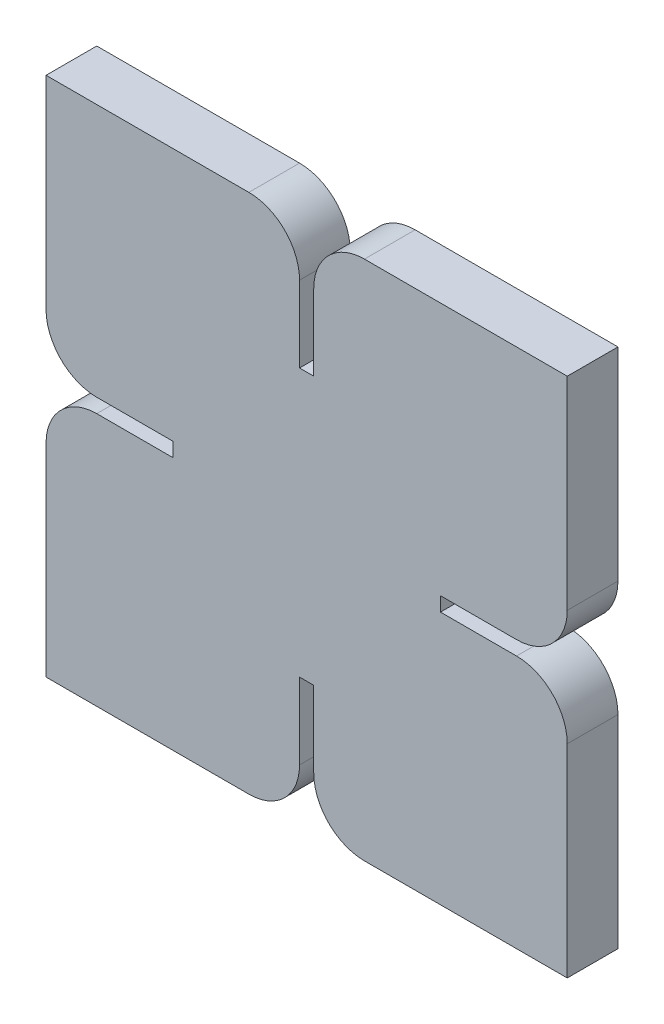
ISO-10303-21;
HEADER;
FILE_DESCRIPTION(('STEP AP214'),'2;1');
FILE_NAME('part.step','',(''),(''),'','','');
FILE_SCHEMA(('AUTOMOTIVE_DESIGN { 1 0 10303 214 1 1 1 1 }'));
ENDSEC;
DATA;
#1=APPLICATION_CONTEXT('core data for automotive mechanical design processes');
#2=APPLICATION_PROTOCOL_DEFINITION('international standard','automotive_design',2000,#1);
#3=PRODUCT_CONTEXT('',#1,'mechanical');
#4=PRODUCT('Part','Part','',(#3));
#5=PRODUCT_RELATED_PRODUCT_CATEGORY('part','',(#4));
#6=PRODUCT_DEFINITION_FORMATION('','',#4);
#7=PRODUCT_DEFINITION_CONTEXT('part definition',#1,'design');
#8=PRODUCT_DEFINITION('design','',#6,#7);
#9=PRODUCT_DEFINITION_SHAPE('','',#8);
#10=(LENGTH_UNIT() NAMED_UNIT(*) SI_UNIT(.MILLI.,.METRE.));
#11=(NAMED_UNIT(*) PLANE_ANGLE_UNIT() SI_UNIT($,.RADIAN.));
#12=(NAMED_UNIT(*) SI_UNIT($,.STERADIAN.) SOLID_ANGLE_UNIT());
#13=UNCERTAINTY_MEASURE_WITH_UNIT(LENGTH_MEASURE(1.E-05),#10,'distance_accuracy_value','');
#14=(GEOMETRIC_REPRESENTATION_CONTEXT(3) GLOBAL_UNCERTAINTY_ASSIGNED_CONTEXT((#13)) GLOBAL_UNIT_ASSIGNED_CONTEXT((#10,
#11,#12)) REPRESENTATION_CONTEXT('',''));
#15=CARTESIAN_POINT('',(0.,0.,0.));
#16=DIRECTION('',(0.,0.,1.));
#17=DIRECTION('',(1.,0.,0.));
#18=AXIS2_PLACEMENT_3D('',#15,#16,#17);
#19=CARTESIAN_POINT('',(-11.4,-41.4,10.));
#20=DIRECTION('',(0.,0.,-1.));
#21=DIRECTION('',(-1.,0.,0.));
#22=AXIS2_PLACEMENT_3D('',#19,#20,#21);
#23=CYLINDRICAL_SURFACE('',#22,10.);
#24=CARTESIAN_POINT('',(-11.4,-41.4,0.));
#25=DIRECTION('',(0.,0.,1.));
#26=DIRECTION('',(1.,0.,0.));
#27=AXIS2_PLACEMENT_3D('',#24,#25,#26);
#28=CIRCLE('',#27,10.);
#29=CARTESIAN_POINT('',(-1.39999999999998,-41.4,0.));
#30=VERTEX_POINT('',#29);
#31=CARTESIAN_POINT('',(-11.4,-51.4,0.));
#32=VERTEX_POINT('',#31);
#33=EDGE_CURVE('E246',#30,#32,#28,.F.);
#34=ORIENTED_EDGE('',*,*,#33,.F.);
#35=DIRECTION('',(0.,0.,-1.));
#36=VECTOR('',#35,1.);
#37=CARTESIAN_POINT('',(-1.39999999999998,-41.4,10.));
#38=LINE('',#37,#36);
#39=CARTESIAN_POINT('',(-1.39999999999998,-41.4,10.));
#40=VERTEX_POINT('',#39);
#41=EDGE_CURVE('E11',#40,#30,#38,.T.);
#42=ORIENTED_EDGE('',*,*,#41,.F.);
#43=CARTESIAN_POINT('',(-11.4,-41.4,10.));
#44=DIRECTION('',(0.,0.,1.));
#45=DIRECTION('',(1.,0.,0.));
#46=AXIS2_PLACEMENT_3D('',#43,#44,#45);
#47=CIRCLE('',#46,10.);
#48=CARTESIAN_POINT('',(-11.4,-51.4,10.));
#49=VERTEX_POINT('',#48);
#50=EDGE_CURVE('E319',#40,#49,#47,.F.);
#51=ORIENTED_EDGE('',*,*,#50,.T.);
#52=DIRECTION('',(0.,0.,-1.));
#53=VECTOR('',#52,1.);
#54=CARTESIAN_POINT('',(-11.4,-51.4,10.));
#55=LINE('',#54,#53);
#56=EDGE_CURVE('E146',#49,#32,#55,.T.);
#57=ORIENTED_EDGE('',*,*,#56,.T.);
#58=EDGE_LOOP('',(#34,#42,#51,#57));
#59=FACE_BOUND('',#58,.T.);
#60=ADVANCED_FACE('F35',(#59),#23,.T.);
#61=CARTESIAN_POINT('',(-1.40000000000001,0.,10.));
#62=DIRECTION('',(1.,0.,0.));
#63=DIRECTION('',(0.,1.,0.));
#64=AXIS2_PLACEMENT_3D('',#61,#62,#63);
#65=PLANE('',#64);
#66=DIRECTION('',(0.,-1.,0.));
#67=VECTOR('',#66,1.);
#68=CARTESIAN_POINT('',(-1.40000000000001,0.,0.));
#69=LINE('',#68,#67);
#70=CARTESIAN_POINT('',(-1.39999999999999,-26.4,0.));
#71=VERTEX_POINT('',#70);
#72=EDGE_CURVE('E249',#71,#30,#69,.T.);
#73=ORIENTED_EDGE('',*,*,#72,.F.);
#74=DIRECTION('',(0.,0.,-1.));
#75=VECTOR('',#74,1.);
#76=CARTESIAN_POINT('',(-1.39999999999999,-26.4,10.));
#77=LINE('',#76,#75);
#78=CARTESIAN_POINT('',(-1.39999999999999,-26.4,10.));
#79=VERTEX_POINT('',#78);
#80=EDGE_CURVE('E43',#79,#71,#77,.T.);
#81=ORIENTED_EDGE('',*,*,#80,.F.);
#82=DIRECTION('',(0.,-1.,0.));
#83=VECTOR('',#82,1.);
#84=CARTESIAN_POINT('',(-1.40000000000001,0.,10.));
#85=LINE('',#84,#83);
#86=EDGE_CURVE('E387',#79,#40,#85,.T.);
#87=ORIENTED_EDGE('',*,*,#86,.T.);
#88=ORIENTED_EDGE('',*,*,#41,.T.);
#89=EDGE_LOOP('',(#73,#81,#87,#88));
#90=FACE_BOUND('',#89,.T.);
#91=ADVANCED_FACE('F386',(#90),#65,.T.);
#92=CARTESIAN_POINT('',(0.,-26.4,10.));
#93=DIRECTION('',(0.,1.,0.));
#94=DIRECTION('',(0.,0.,1.));
#95=AXIS2_PLACEMENT_3D('',#92,#93,#94);
#96=PLANE('',#95);
#97=DIRECTION('',(1.,0.,0.));
#98=VECTOR('',#97,1.);
#99=CARTESIAN_POINT('',(0.,-26.4,0.));
#100=LINE('',#99,#98);
#101=CARTESIAN_POINT('',(1.40000000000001,-26.4,0.));
#102=VERTEX_POINT('',#101);
#103=EDGE_CURVE('E252',#71,#102,#100,.T.);
#104=ORIENTED_EDGE('',*,*,#103,.T.);
#105=DIRECTION('',(0.,0.,-1.));
#106=VECTOR('',#105,1.);
#107=CARTESIAN_POINT('',(1.40000000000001,-26.4,10.));
#108=LINE('',#107,#106);
#109=CARTESIAN_POINT('',(1.40000000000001,-26.4,10.));
#110=VERTEX_POINT('',#109);
#111=EDGE_CURVE('E370',#110,#102,#108,.T.);
#112=ORIENTED_EDGE('',*,*,#111,.F.);
#113=DIRECTION('',(1.,0.,0.));
#114=VECTOR('',#113,1.);
#115=CARTESIAN_POINT('',(0.,-26.4,10.));
#116=LINE('',#115,#114);
#117=EDGE_CURVE('E377',#79,#110,#116,.T.);
#118=ORIENTED_EDGE('',*,*,#117,.F.);
#119=ORIENTED_EDGE('',*,*,#80,.T.);
#120=EDGE_LOOP('',(#104,#112,#118,#119));
#121=FACE_BOUND('',#120,.T.);
#122=ADVANCED_FACE('F375',(#121),#96,.F.);
#123=CARTESIAN_POINT('',(1.40000000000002,0.,10.));
#124=DIRECTION('',(1.,0.,0.));
#125=DIRECTION('',(0.,1.,0.));
#126=AXIS2_PLACEMENT_3D('',#123,#124,#125);
#127=PLANE('',#126);
#128=DIRECTION('',(0.,-1.,0.));
#129=VECTOR('',#128,1.);
#130=CARTESIAN_POINT('',(1.40000000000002,0.,0.));
#131=LINE('',#130,#129);
#132=CARTESIAN_POINT('',(1.4,-41.4,0.));
#133=VERTEX_POINT('',#132);
#134=EDGE_CURVE('E254',#102,#133,#131,.T.);
#135=ORIENTED_EDGE('',*,*,#134,.T.);
#136=DIRECTION('',(0.,0.,-1.));
#137=VECTOR('',#136,1.);
#138=CARTESIAN_POINT('',(1.4,-41.4,10.));
#139=LINE('',#138,#137);
#140=CARTESIAN_POINT('',(1.4,-41.4,10.));
#141=VERTEX_POINT('',#140);
#142=EDGE_CURVE('E367',#141,#133,#139,.T.);
#143=ORIENTED_EDGE('',*,*,#142,.F.);
#144=DIRECTION('',(0.,-1.,0.));
#145=VECTOR('',#144,1.);
#146=CARTESIAN_POINT('',(1.40000000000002,0.,10.));
#147=LINE('',#146,#145);
#148=EDGE_CURVE('E395',#110,#141,#147,.T.);
#149=ORIENTED_EDGE('',*,*,#148,.F.);
#150=ORIENTED_EDGE('',*,*,#111,.T.);
#151=EDGE_LOOP('',(#135,#143,#149,#150));
#152=FACE_BOUND('',#151,.T.);
#153=ADVANCED_FACE('F538',(#152),#127,.F.);
#154=CARTESIAN_POINT('',(11.4,-41.4,10.));
#155=DIRECTION('',(0.,0.,-1.));
#156=DIRECTION('',(-1.,0.,0.));
#157=AXIS2_PLACEMENT_3D('',#154,#155,#156);
#158=CYLINDRICAL_SURFACE('',#157,10.);
#159=CARTESIAN_POINT('',(11.4,-41.4,0.));
#160=DIRECTION('',(0.,0.,1.));
#161=DIRECTION('',(1.,0.,0.));
#162=AXIS2_PLACEMENT_3D('',#159,#160,#161);
#163=CIRCLE('',#162,10.);
#164=CARTESIAN_POINT('',(11.4,-51.4,0.));
#165=VERTEX_POINT('',#164);
#166=EDGE_CURVE('E256',#133,#165,#163,.T.);
#167=ORIENTED_EDGE('',*,*,#166,.T.);
#168=DIRECTION('',(0.,0.,-1.));
#169=VECTOR('',#168,1.);
#170=CARTESIAN_POINT('',(11.4,-51.4,10.));
#171=LINE('',#170,#169);
#172=CARTESIAN_POINT('',(11.4,-51.4,10.));
#173=VERTEX_POINT('',#172);
#174=EDGE_CURVE('E365',#173,#165,#171,.T.);
#175=ORIENTED_EDGE('',*,*,#174,.F.);
#176=CARTESIAN_POINT('',(11.4,-41.4,10.));
#177=DIRECTION('',(0.,0.,1.));
#178=DIRECTION('',(1.,0.,0.));
#179=AXIS2_PLACEMENT_3D('',#176,#177,#178);
#180=CIRCLE('',#179,10.);
#181=EDGE_CURVE('E397',#141,#173,#180,.T.);
#182=ORIENTED_EDGE('',*,*,#181,.F.);
#183=ORIENTED_EDGE('',*,*,#142,.T.);
#184=EDGE_LOOP('',(#167,#175,#182,#183));
#185=FACE_BOUND('',#184,.T.);
#186=ADVANCED_FACE('F534',(#185),#158,.T.);
#187=CARTESIAN_POINT('',(0.,-51.4,10.));
#188=DIRECTION('',(0.,-1.,0.));
#189=DIRECTION('',(1.,0.,0.));
#190=AXIS2_PLACEMENT_3D('',#187,#188,#189);
#191=PLANE('',#190);
#192=DIRECTION('',(-1.,0.,0.));
#193=VECTOR('',#192,1.);
#194=CARTESIAN_POINT('',(0.,-51.4,0.));
#195=LINE('',#194,#193);
#196=CARTESIAN_POINT('',(51.4,-51.4,0.));
#197=VERTEX_POINT('',#196);
#198=EDGE_CURVE('E259',#197,#165,#195,.T.);
#199=ORIENTED_EDGE('',*,*,#198,.F.);
#200=DIRECTION('',(0.,0.,-1.));
#201=VECTOR('',#200,1.);
#202=CARTESIAN_POINT('',(51.4,-51.4,10.));
#203=LINE('',#202,#201);
#204=CARTESIAN_POINT('',(51.4,-51.4,10.));
#205=VERTEX_POINT('',#204);
#206=EDGE_CURVE('E363',#205,#197,#203,.T.);
#207=ORIENTED_EDGE('',*,*,#206,.F.);
#208=DIRECTION('',(-1.,0.,0.));
#209=VECTOR('',#208,1.);
#210=CARTESIAN_POINT('',(0.,-51.4,10.));
#211=LINE('',#210,#209);
#212=EDGE_CURVE('E399',#205,#173,#211,.T.);
#213=ORIENTED_EDGE('',*,*,#212,.T.);
#214=ORIENTED_EDGE('',*,*,#174,.T.);
#215=EDGE_LOOP('',(#199,#207,#213,#214));
#216=FACE_BOUND('',#215,.T.);
#217=ADVANCED_FACE('F529',(#216),#191,.T.);
#218=CARTESIAN_POINT('',(51.4,0.,10.));
#219=DIRECTION('',(1.,0.,0.));
#220=DIRECTION('',(0.,1.,0.));
#221=AXIS2_PLACEMENT_3D('',#218,#219,#220);
#222=PLANE('',#221);
#223=DIRECTION('',(0.,-1.,0.));
#224=VECTOR('',#223,1.);
#225=CARTESIAN_POINT('',(51.4,0.,0.));
#226=LINE('',#225,#224);
#227=CARTESIAN_POINT('',(51.4,-11.4,0.));
#228=VERTEX_POINT('',#227);
#229=EDGE_CURVE('E262',#228,#197,#226,.T.);
#230=ORIENTED_EDGE('',*,*,#229,.F.);
#231=DIRECTION('',(0.,0.,-1.));
#232=VECTOR('',#231,1.);
#233=CARTESIAN_POINT('',(51.4,-11.4,10.));
#234=LINE('',#233,#232);
#235=CARTESIAN_POINT('',(51.4,-11.4,10.));
#236=VERTEX_POINT('',#235);
#237=EDGE_CURVE('E361',#236,#228,#234,.T.);
#238=ORIENTED_EDGE('',*,*,#237,.F.);
#239=DIRECTION('',(0.,-1.,0.));
#240=VECTOR('',#239,1.);
#241=CARTESIAN_POINT('',(51.4,0.,10.));
#242=LINE('',#241,#240);
#243=EDGE_CURVE('E402',#236,#205,#242,.T.);
#244=ORIENTED_EDGE('',*,*,#243,.T.);
#245=ORIENTED_EDGE('',*,*,#206,.T.);
#246=EDGE_LOOP('',(#230,#238,#244,#245));
#247=FACE_BOUND('',#246,.T.);
#248=ADVANCED_FACE('F526',(#247),#222,.T.);
#249=CARTESIAN_POINT('',(41.4,-11.4,10.));
#250=DIRECTION('',(0.,0.,-1.));
#251=DIRECTION('',(-1.,0.,0.));
#252=AXIS2_PLACEMENT_3D('',#249,#250,#251);
#253=CYLINDRICAL_SURFACE('',#252,10.);
#254=CARTESIAN_POINT('',(41.4,-11.4,0.));
#255=DIRECTION('',(0.,0.,1.));
#256=DIRECTION('',(1.,0.,0.));
#257=AXIS2_PLACEMENT_3D('',#254,#255,#256);
#258=CIRCLE('',#257,10.);
#259=CARTESIAN_POINT('',(41.4,-1.40000000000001,0.));
#260=VERTEX_POINT('',#259);
#261=EDGE_CURVE('E265',#260,#228,#258,.F.);
#262=ORIENTED_EDGE('',*,*,#261,.F.);
#263=DIRECTION('',(0.,0.,-1.));
#264=VECTOR('',#263,1.);
#265=CARTESIAN_POINT('',(41.4,-1.40000000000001,10.));
#266=LINE('',#265,#264);
#267=CARTESIAN_POINT('',(41.4,-1.40000000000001,10.));
#268=VERTEX_POINT('',#267);
#269=EDGE_CURVE('E359',#268,#260,#266,.T.);
#270=ORIENTED_EDGE('',*,*,#269,.F.);
#271=CARTESIAN_POINT('',(41.4,-11.4,10.));
#272=DIRECTION('',(0.,0.,1.));
#273=DIRECTION('',(1.,0.,0.));
#274=AXIS2_PLACEMENT_3D('',#271,#272,#273);
#275=CIRCLE('',#274,10.);
#276=EDGE_CURVE('E405',#268,#236,#275,.F.);
#277=ORIENTED_EDGE('',*,*,#276,.T.);
#278=ORIENTED_EDGE('',*,*,#237,.T.);
#279=EDGE_LOOP('',(#262,#270,#277,#278));
#280=FACE_BOUND('',#279,.T.);
#281=ADVANCED_FACE('F520',(#280),#253,.T.);
#282=CARTESIAN_POINT('',(0.,-1.4,10.));
#283=DIRECTION('',(0.,-1.,0.));
#284=DIRECTION('',(1.,0.,0.));
#285=AXIS2_PLACEMENT_3D('',#282,#283,#284);
#286=PLANE('',#285);
#287=DIRECTION('',(-1.,0.,0.));
#288=VECTOR('',#287,1.);
#289=CARTESIAN_POINT('',(0.,-1.4,0.));
#290=LINE('',#289,#288);
#291=CARTESIAN_POINT('',(26.4,-1.40000000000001,0.));
#292=VERTEX_POINT('',#291);
#293=EDGE_CURVE('E268',#260,#292,#290,.T.);
#294=ORIENTED_EDGE('',*,*,#293,.T.);
#295=DIRECTION('',(0.,0.,-1.));
#296=VECTOR('',#295,1.);
#297=CARTESIAN_POINT('',(26.4,-1.40000000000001,10.));
#298=LINE('',#297,#296);
#299=CARTESIAN_POINT('',(26.4,-1.40000000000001,10.));
#300=VERTEX_POINT('',#299);
#301=EDGE_CURVE('E357',#300,#292,#298,.T.);
#302=ORIENTED_EDGE('',*,*,#301,.F.);
#303=DIRECTION('',(-1.,0.,0.));
#304=VECTOR('',#303,1.);
#305=CARTESIAN_POINT('',(0.,-1.4,10.));
#306=LINE('',#305,#304);
#307=EDGE_CURVE('E408',#268,#300,#306,.T.);
#308=ORIENTED_EDGE('',*,*,#307,.F.);
#309=ORIENTED_EDGE('',*,*,#269,.T.);
#310=EDGE_LOOP('',(#294,#302,#308,#309));
#311=FACE_BOUND('',#310,.T.);
#312=ADVANCED_FACE('F539',(#311),#286,.F.);
#313=CARTESIAN_POINT('',(26.4,0.,10.));
#314=DIRECTION('',(1.,0.,0.));
#315=DIRECTION('',(0.,0.,-1.));
#316=AXIS2_PLACEMENT_3D('',#313,#314,#315);
#317=PLANE('',#316);
#318=DIRECTION('',(0.,-1.,0.));
#319=VECTOR('',#318,1.);
#320=CARTESIAN_POINT('',(26.4,0.,0.));
#321=LINE('',#320,#319);
#322=CARTESIAN_POINT('',(26.4,1.40000000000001,0.));
#323=VERTEX_POINT('',#322);
#324=EDGE_CURVE('E271',#323,#292,#321,.T.);
#325=ORIENTED_EDGE('',*,*,#324,.F.);
#326=DIRECTION('',(0.,0.,-1.));
#327=VECTOR('',#326,1.);
#328=CARTESIAN_POINT('',(26.4,1.40000000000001,10.));
#329=LINE('',#328,#327);
#330=CARTESIAN_POINT('',(26.4,1.40000000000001,10.));
#331=VERTEX_POINT('',#330);
#332=EDGE_CURVE('E355',#331,#323,#329,.T.);
#333=ORIENTED_EDGE('',*,*,#332,.F.);
#334=DIRECTION('',(0.,-1.,0.));
#335=VECTOR('',#334,1.);
#336=CARTESIAN_POINT('',(26.4,0.,10.));
#337=LINE('',#336,#335);
#338=EDGE_CURVE('E410',#331,#300,#337,.T.);
#339=ORIENTED_EDGE('',*,*,#338,.T.);
#340=ORIENTED_EDGE('',*,*,#301,.T.);
#341=EDGE_LOOP('',(#325,#333,#339,#340));
#342=FACE_BOUND('',#341,.T.);
#343=ADVANCED_FACE('F514',(#342),#317,.T.);
#344=CARTESIAN_POINT('',(0.,1.4,10.));
#345=DIRECTION('',(0.,-1.,0.));
#346=DIRECTION('',(1.,0.,0.));
#347=AXIS2_PLACEMENT_3D('',#344,#345,#346);
#348=PLANE('',#347);
#349=DIRECTION('',(-1.,0.,0.));
#350=VECTOR('',#349,1.);
#351=CARTESIAN_POINT('',(0.,1.4,0.));
#352=LINE('',#351,#350);
#353=CARTESIAN_POINT('',(41.4,1.40000000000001,0.));
#354=VERTEX_POINT('',#353);
#355=EDGE_CURVE('E274',#354,#323,#352,.T.);
#356=ORIENTED_EDGE('',*,*,#355,.F.);
#357=DIRECTION('',(0.,0.,-1.));
#358=VECTOR('',#357,1.);
#359=CARTESIAN_POINT('',(41.4,1.40000000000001,10.));
#360=LINE('',#359,#358);
#361=CARTESIAN_POINT('',(41.4,1.40000000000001,10.));
#362=VERTEX_POINT('',#361);
#363=EDGE_CURVE('E353',#362,#354,#360,.T.);
#364=ORIENTED_EDGE('',*,*,#363,.F.);
#365=DIRECTION('',(-1.,0.,0.));
#366=VECTOR('',#365,1.);
#367=CARTESIAN_POINT('',(0.,1.4,10.));
#368=LINE('',#367,#366);
#369=EDGE_CURVE('E413',#362,#331,#368,.T.);
#370=ORIENTED_EDGE('',*,*,#369,.T.);
#371=ORIENTED_EDGE('',*,*,#332,.T.);
#372=EDGE_LOOP('',(#356,#364,#370,#371));
#373=FACE_BOUND('',#372,.T.);
#374=ADVANCED_FACE('F508',(#373),#348,.T.);
#375=CARTESIAN_POINT('',(41.4,11.4,10.));
#376=DIRECTION('',(0.,0.,-1.));
#377=DIRECTION('',(-1.,0.,0.));
#378=AXIS2_PLACEMENT_3D('',#375,#376,#377);
#379=CYLINDRICAL_SURFACE('',#378,10.);
#380=CARTESIAN_POINT('',(41.4,11.4,0.));
#381=DIRECTION('',(0.,0.,1.));
#382=DIRECTION('',(1.,0.,0.));
#383=AXIS2_PLACEMENT_3D('',#380,#381,#382);
#384=CIRCLE('',#383,10.);
#385=CARTESIAN_POINT('',(51.4,11.4,0.));
#386=VERTEX_POINT('',#385);
#387=EDGE_CURVE('E277',#354,#386,#384,.T.);
#388=ORIENTED_EDGE('',*,*,#387,.T.);
#389=DIRECTION('',(0.,0.,-1.));
#390=VECTOR('',#389,1.);
#391=CARTESIAN_POINT('',(51.4,11.4,10.));
#392=LINE('',#391,#390);
#393=CARTESIAN_POINT('',(51.4,11.4,10.));
#394=VERTEX_POINT('',#393);
#395=EDGE_CURVE('E350',#394,#386,#392,.T.);
#396=ORIENTED_EDGE('',*,*,#395,.F.);
#397=CARTESIAN_POINT('',(41.4,11.4,10.));
#398=DIRECTION('',(0.,0.,1.));
#399=DIRECTION('',(1.,0.,0.));
#400=AXIS2_PLACEMENT_3D('',#397,#398,#399);
#401=CIRCLE('',#400,10.);
#402=EDGE_CURVE('E416',#362,#394,#401,.T.);
#403=ORIENTED_EDGE('',*,*,#402,.F.);
#404=ORIENTED_EDGE('',*,*,#363,.T.);
#405=EDGE_LOOP('',(#388,#396,#403,#404));
#406=FACE_BOUND('',#405,.T.);
#407=ADVANCED_FACE('F591',(#406),#379,.T.);
#408=CARTESIAN_POINT('',(51.4,0.,10.));
#409=DIRECTION('',(-1.,0.,0.));
#410=DIRECTION('',(0.,-1.,0.));
#411=AXIS2_PLACEMENT_3D('',#408,#409,#410);
#412=PLANE('',#411);
#413=DIRECTION('',(0.,1.,0.));
#414=VECTOR('',#413,1.);
#415=CARTESIAN_POINT('',(51.4,0.,0.));
#416=LINE('',#415,#414);
#417=CARTESIAN_POINT('',(51.4,51.4,0.));
#418=VERTEX_POINT('',#417);
#419=EDGE_CURVE('E279',#386,#418,#416,.T.);
#420=ORIENTED_EDGE('',*,*,#419,.T.);
#421=DIRECTION('',(0.,0.,-1.));
#422=VECTOR('',#421,1.);
#423=CARTESIAN_POINT('',(51.4,51.4,10.));
#424=LINE('',#423,#422);
#425=CARTESIAN_POINT('',(51.4,51.4,10.));
#426=VERTEX_POINT('',#425);
#427=EDGE_CURVE('E347',#426,#418,#424,.T.);
#428=ORIENTED_EDGE('',*,*,#427,.F.);
#429=DIRECTION('',(0.,1.,0.));
#430=VECTOR('',#429,1.);
#431=CARTESIAN_POINT('',(51.4,0.,10.));
#432=LINE('',#431,#430);
#433=EDGE_CURVE('E418',#394,#426,#432,.T.);
#434=ORIENTED_EDGE('',*,*,#433,.F.);
#435=ORIENTED_EDGE('',*,*,#395,.T.);
#436=EDGE_LOOP('',(#420,#428,#434,#435));
#437=FACE_BOUND('',#436,.T.);
#438=ADVANCED_FACE('F502',(#437),#412,.F.);
#439=CARTESIAN_POINT('',(0.,51.4,10.));
#440=DIRECTION('',(0.,-1.,0.));
#441=DIRECTION('',(1.,0.,0.));
#442=AXIS2_PLACEMENT_3D('',#439,#440,#441);
#443=PLANE('',#442);
#444=DIRECTION('',(-1.,0.,0.));
#445=VECTOR('',#444,1.);
#446=CARTESIAN_POINT('',(0.,51.4,0.));
#447=LINE('',#446,#445);
#448=CARTESIAN_POINT('',(11.4,51.4,0.));
#449=VERTEX_POINT('',#448);
#450=EDGE_CURVE('E281',#418,#449,#447,.T.);
#451=ORIENTED_EDGE('',*,*,#450,.T.);
#452=DIRECTION('',(0.,0.,-1.));
#453=VECTOR('',#452,1.);
#454=CARTESIAN_POINT('',(11.4,51.4,10.));
#455=LINE('',#454,#453);
#456=CARTESIAN_POINT('',(11.4,51.4,10.));
#457=VERTEX_POINT('',#456);
#458=EDGE_CURVE('E345',#457,#449,#455,.T.);
#459=ORIENTED_EDGE('',*,*,#458,.F.);
#460=DIRECTION('',(-1.,0.,0.));
#461=VECTOR('',#460,1.);
#462=CARTESIAN_POINT('',(0.,51.4,10.));
#463=LINE('',#462,#461);
#464=EDGE_CURVE('E420',#426,#457,#463,.T.);
#465=ORIENTED_EDGE('',*,*,#464,.F.);
#466=ORIENTED_EDGE('',*,*,#427,.T.);
#467=EDGE_LOOP('',(#451,#459,#465,#466));
#468=FACE_BOUND('',#467,.T.);
#469=ADVANCED_FACE('F498',(#468),#443,.F.);
#470=CARTESIAN_POINT('',(11.4,41.4,10.));
#471=DIRECTION('',(0.,0.,-1.));
#472=DIRECTION('',(-1.,0.,0.));
#473=AXIS2_PLACEMENT_3D('',#470,#471,#472);
#474=CYLINDRICAL_SURFACE('',#473,10.);
#475=CARTESIAN_POINT('',(11.4,41.4,0.));
#476=DIRECTION('',(0.,0.,1.));
#477=DIRECTION('',(1.,0.,0.));
#478=AXIS2_PLACEMENT_3D('',#475,#476,#477);
#479=CIRCLE('',#478,10.);
#480=CARTESIAN_POINT('',(1.4,41.4,0.));
#481=VERTEX_POINT('',#480);
#482=EDGE_CURVE('E284',#481,#449,#479,.F.);
#483=ORIENTED_EDGE('',*,*,#482,.F.);
#484=DIRECTION('',(0.,0.,-1.));
#485=VECTOR('',#484,1.);
#486=CARTESIAN_POINT('',(1.4,41.4,10.));
#487=LINE('',#486,#485);
#488=CARTESIAN_POINT('',(1.4,41.4,10.));
#489=VERTEX_POINT('',#488);
#490=EDGE_CURVE('E343',#489,#481,#487,.T.);
#491=ORIENTED_EDGE('',*,*,#490,.F.);
#492=CARTESIAN_POINT('',(11.4,41.4,10.));
#493=DIRECTION('',(0.,0.,1.));
#494=DIRECTION('',(1.,0.,0.));
#495=AXIS2_PLACEMENT_3D('',#492,#493,#494);
#496=CIRCLE('',#495,10.);
#497=EDGE_CURVE('E422',#489,#457,#496,.F.);
#498=ORIENTED_EDGE('',*,*,#497,.T.);
#499=ORIENTED_EDGE('',*,*,#458,.T.);
#500=EDGE_LOOP('',(#483,#491,#498,#499));
#501=FACE_BOUND('',#500,.T.);
#502=ADVANCED_FACE('F493',(#501),#474,.T.);
#503=CARTESIAN_POINT('',(1.40000000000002,0.,10.));
#504=DIRECTION('',(-1.,0.,0.));
#505=DIRECTION('',(0.,-1.,0.));
#506=AXIS2_PLACEMENT_3D('',#503,#504,#505);
#507=PLANE('',#506);
#508=DIRECTION('',(0.,1.,0.));
#509=VECTOR('',#508,1.);
#510=CARTESIAN_POINT('',(1.40000000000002,0.,0.));
#511=LINE('',#510,#509);
#512=CARTESIAN_POINT('',(1.40000000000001,26.4,0.));
#513=VERTEX_POINT('',#512);
#514=EDGE_CURVE('E287',#513,#481,#511,.T.);
#515=ORIENTED_EDGE('',*,*,#514,.F.);
#516=DIRECTION('',(0.,0.,-1.));
#517=VECTOR('',#516,1.);
#518=CARTESIAN_POINT('',(1.40000000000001,26.4,10.));
#519=LINE('',#518,#517);
#520=CARTESIAN_POINT('',(1.40000000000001,26.4,10.));
#521=VERTEX_POINT('',#520);
#522=EDGE_CURVE('E341',#521,#513,#519,.T.);
#523=ORIENTED_EDGE('',*,*,#522,.F.);
#524=DIRECTION('',(0.,1.,0.));
#525=VECTOR('',#524,1.);
#526=CARTESIAN_POINT('',(1.40000000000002,0.,10.));
#527=LINE('',#526,#525);
#528=EDGE_CURVE('E425',#521,#489,#527,.T.);
#529=ORIENTED_EDGE('',*,*,#528,.T.);
#530=ORIENTED_EDGE('',*,*,#490,.T.);
#531=EDGE_LOOP('',(#515,#523,#529,#530));
#532=FACE_BOUND('',#531,.T.);
#533=ADVANCED_FACE('F488',(#532),#507,.T.);
#534=CARTESIAN_POINT('',(0.,26.4,10.));
#535=DIRECTION('',(0.,1.,0.));
#536=DIRECTION('',(0.,0.,1.));
#537=AXIS2_PLACEMENT_3D('',#534,#535,#536);
#538=PLANE('',#537);
#539=DIRECTION('',(1.,0.,0.));
#540=VECTOR('',#539,1.);
#541=CARTESIAN_POINT('',(0.,26.4,0.));
#542=LINE('',#541,#540);
#543=CARTESIAN_POINT('',(-1.4,26.4,0.));
#544=VERTEX_POINT('',#543);
#545=EDGE_CURVE('E290',#544,#513,#542,.T.);
#546=ORIENTED_EDGE('',*,*,#545,.F.);
#547=DIRECTION('',(0.,0.,-1.));
#548=VECTOR('',#547,1.);
#549=CARTESIAN_POINT('',(-1.4,26.4,10.));
#550=LINE('',#549,#548);
#551=CARTESIAN_POINT('',(-1.4,26.4,10.));
#552=VERTEX_POINT('',#551);
#553=EDGE_CURVE('E339',#552,#544,#550,.T.);
#554=ORIENTED_EDGE('',*,*,#553,.F.);
#555=DIRECTION('',(1.,0.,0.));
#556=VECTOR('',#555,1.);
#557=CARTESIAN_POINT('',(0.,26.4,10.));
#558=LINE('',#557,#556);
#559=EDGE_CURVE('E428',#552,#521,#558,.T.);
#560=ORIENTED_EDGE('',*,*,#559,.T.);
#561=ORIENTED_EDGE('',*,*,#522,.T.);
#562=EDGE_LOOP('',(#546,#554,#560,#561));
#563=FACE_BOUND('',#562,.T.);
#564=ADVANCED_FACE('F482',(#563),#538,.T.);
#565=CARTESIAN_POINT('',(-1.40000000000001,0.,10.));
#566=DIRECTION('',(-1.,0.,0.));
#567=DIRECTION('',(0.,-1.,0.));
#568=AXIS2_PLACEMENT_3D('',#565,#566,#567);
#569=PLANE('',#568);
#570=DIRECTION('',(0.,1.,0.));
#571=VECTOR('',#570,1.);
#572=CARTESIAN_POINT('',(-1.40000000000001,0.,0.));
#573=LINE('',#572,#571);
#574=CARTESIAN_POINT('',(-1.4,41.4,0.));
#575=VERTEX_POINT('',#574);
#576=EDGE_CURVE('E293',#544,#575,#573,.T.);
#577=ORIENTED_EDGE('',*,*,#576,.T.);
#578=DIRECTION('',(0.,0.,-1.));
#579=VECTOR('',#578,1.);
#580=CARTESIAN_POINT('',(-1.4,41.4,10.));
#581=LINE('',#580,#579);
#582=CARTESIAN_POINT('',(-1.4,41.4,10.));
#583=VERTEX_POINT('',#582);
#584=EDGE_CURVE('E336',#583,#575,#581,.T.);
#585=ORIENTED_EDGE('',*,*,#584,.F.);
#586=DIRECTION('',(0.,1.,0.));
#587=VECTOR('',#586,1.);
#588=CARTESIAN_POINT('',(-1.40000000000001,0.,10.));
#589=LINE('',#588,#587);
#590=EDGE_CURVE('E431',#552,#583,#589,.T.);
#591=ORIENTED_EDGE('',*,*,#590,.F.);
#592=ORIENTED_EDGE('',*,*,#553,.T.);
#593=EDGE_LOOP('',(#577,#585,#591,#592));
#594=FACE_BOUND('',#593,.T.);
#595=ADVANCED_FACE('F640',(#594),#569,.F.);
#596=CARTESIAN_POINT('',(-11.4,41.4,10.));
#597=DIRECTION('',(0.,0.,-1.));
#598=DIRECTION('',(-1.,0.,0.));
#599=AXIS2_PLACEMENT_3D('',#596,#597,#598);
#600=CYLINDRICAL_SURFACE('',#599,10.);
#601=CARTESIAN_POINT('',(-11.4,41.4,0.));
#602=DIRECTION('',(0.,0.,1.));
#603=DIRECTION('',(1.,0.,0.));
#604=AXIS2_PLACEMENT_3D('',#601,#602,#603);
#605=CIRCLE('',#604,10.);
#606=CARTESIAN_POINT('',(-11.4,51.4,0.));
#607=VERTEX_POINT('',#606);
#608=EDGE_CURVE('E295',#575,#607,#605,.T.);
#609=ORIENTED_EDGE('',*,*,#608,.T.);
#610=DIRECTION('',(0.,0.,-1.));
#611=VECTOR('',#610,1.);
#612=CARTESIAN_POINT('',(-11.4,51.4,10.));
#613=LINE('',#612,#611);
#614=CARTESIAN_POINT('',(-11.4,51.4,10.));
#615=VERTEX_POINT('',#614);
#616=EDGE_CURVE('E334',#615,#607,#613,.T.);
#617=ORIENTED_EDGE('',*,*,#616,.F.);
#618=CARTESIAN_POINT('',(-11.4,41.4,10.));
#619=DIRECTION('',(0.,0.,1.));
#620=DIRECTION('',(1.,0.,0.));
#621=AXIS2_PLACEMENT_3D('',#618,#619,#620);
#622=CIRCLE('',#621,10.);
#623=EDGE_CURVE('E433',#583,#615,#622,.T.);
#624=ORIENTED_EDGE('',*,*,#623,.F.);
#625=ORIENTED_EDGE('',*,*,#584,.T.);
#626=EDGE_LOOP('',(#609,#617,#624,#625));
#627=FACE_BOUND('',#626,.T.);
#628=ADVANCED_FACE('F476',(#627),#600,.T.);
#629=CARTESIAN_POINT('',(0.,51.4,10.));
#630=DIRECTION('',(0.,1.,0.));
#631=DIRECTION('',(0.,0.,1.));
#632=AXIS2_PLACEMENT_3D('',#629,#630,#631);
#633=PLANE('',#632);
#634=DIRECTION('',(1.,0.,0.));
#635=VECTOR('',#634,1.);
#636=CARTESIAN_POINT('',(0.,51.4,0.));
#637=LINE('',#636,#635);
#638=CARTESIAN_POINT('',(-51.4,51.4,0.));
#639=VERTEX_POINT('',#638);
#640=EDGE_CURVE('E298',#639,#607,#637,.T.);
#641=ORIENTED_EDGE('',*,*,#640,.F.);
#642=DIRECTION('',(0.,0.,-1.));
#643=VECTOR('',#642,1.);
#644=CARTESIAN_POINT('',(-51.4,51.4,10.));
#645=LINE('',#644,#643);
#646=CARTESIAN_POINT('',(-51.4,51.4,10.));
#647=VERTEX_POINT('',#646);
#648=EDGE_CURVE('E332',#647,#639,#645,.T.);
#649=ORIENTED_EDGE('',*,*,#648,.F.);
#650=DIRECTION('',(1.,0.,0.));
#651=VECTOR('',#650,1.);
#652=CARTESIAN_POINT('',(0.,51.4,10.));
#653=LINE('',#652,#651);
#654=EDGE_CURVE('E435',#647,#615,#653,.T.);
#655=ORIENTED_EDGE('',*,*,#654,.T.);
#656=ORIENTED_EDGE('',*,*,#616,.T.);
#657=EDGE_LOOP('',(#641,#649,#655,#656));
#658=FACE_BOUND('',#657,.T.);
#659=ADVANCED_FACE('F472',(#658),#633,.T.);
#660=CARTESIAN_POINT('',(-51.4,0.,10.));
#661=DIRECTION('',(-1.,0.,0.));
#662=DIRECTION('',(0.,-1.,0.));
#663=AXIS2_PLACEMENT_3D('',#660,#661,#662);
#664=PLANE('',#663);
#665=DIRECTION('',(0.,1.,0.));
#666=VECTOR('',#665,1.);
#667=CARTESIAN_POINT('',(-51.4,0.,0.));
#668=LINE('',#667,#666);
#669=CARTESIAN_POINT('',(-51.4,11.4,0.));
#670=VERTEX_POINT('',#669);
#671=EDGE_CURVE('E301',#670,#639,#668,.T.);
#672=ORIENTED_EDGE('',*,*,#671,.F.);
#673=DIRECTION('',(0.,0.,-1.));
#674=VECTOR('',#673,1.);
#675=CARTESIAN_POINT('',(-51.4,11.4,10.));
#676=LINE('',#675,#674);
#677=CARTESIAN_POINT('',(-51.4,11.4,10.));
#678=VERTEX_POINT('',#677);
#679=EDGE_CURVE('E330',#678,#670,#676,.T.);
#680=ORIENTED_EDGE('',*,*,#679,.F.);
#681=DIRECTION('',(0.,1.,0.));
#682=VECTOR('',#681,1.);
#683=CARTESIAN_POINT('',(-51.4,0.,10.));
#684=LINE('',#683,#682);
#685=EDGE_CURVE('E438',#678,#647,#684,.T.);
#686=ORIENTED_EDGE('',*,*,#685,.T.);
#687=ORIENTED_EDGE('',*,*,#648,.T.);
#688=EDGE_LOOP('',(#672,#680,#686,#687));
#689=FACE_BOUND('',#688,.T.);
#690=ADVANCED_FACE('F468',(#689),#664,.T.);
#691=CARTESIAN_POINT('',(-41.4,11.4,10.));
#692=DIRECTION('',(0.,0.,-1.));
#693=DIRECTION('',(-1.,0.,0.));
#694=AXIS2_PLACEMENT_3D('',#691,#692,#693);
#695=CYLINDRICAL_SURFACE('',#694,10.);
#696=CARTESIAN_POINT('',(-41.4,11.4,0.));
#697=DIRECTION('',(0.,0.,1.));
#698=DIRECTION('',(1.,0.,0.));
#699=AXIS2_PLACEMENT_3D('',#696,#697,#698);
#700=CIRCLE('',#699,10.);
#701=CARTESIAN_POINT('',(-41.4,1.4,0.));
#702=VERTEX_POINT('',#701);
#703=EDGE_CURVE('E304',#702,#670,#700,.F.);
#704=ORIENTED_EDGE('',*,*,#703,.F.);
#705=DIRECTION('',(0.,0.,-1.));
#706=VECTOR('',#705,1.);
#707=CARTESIAN_POINT('',(-41.4,1.4,10.));
#708=LINE('',#707,#706);
#709=CARTESIAN_POINT('',(-41.4,1.4,10.));
#710=VERTEX_POINT('',#709);
#711=EDGE_CURVE('E328',#710,#702,#708,.T.);
#712=ORIENTED_EDGE('',*,*,#711,.F.);
#713=CARTESIAN_POINT('',(-41.4,11.4,10.));
#714=DIRECTION('',(0.,0.,1.));
#715=DIRECTION('',(1.,0.,0.));
#716=AXIS2_PLACEMENT_3D('',#713,#714,#715);
#717=CIRCLE('',#716,10.);
#718=EDGE_CURVE('E441',#710,#678,#717,.F.);
#719=ORIENTED_EDGE('',*,*,#718,.T.);
#720=ORIENTED_EDGE('',*,*,#679,.T.);
#721=EDGE_LOOP('',(#704,#712,#719,#720));
#722=FACE_BOUND('',#721,.T.);
#723=ADVANCED_FACE('F463',(#722),#695,.T.);
#724=CARTESIAN_POINT('',(0.,1.4,10.));
#725=DIRECTION('',(0.,1.,0.));
#726=DIRECTION('',(-1.,0.,0.));
#727=AXIS2_PLACEMENT_3D('',#724,#725,#726);
#728=PLANE('',#727);
#729=DIRECTION('',(1.,0.,0.));
#730=VECTOR('',#729,1.);
#731=CARTESIAN_POINT('',(0.,1.4,0.));
#732=LINE('',#731,#730);
#733=CARTESIAN_POINT('',(-26.4,1.4,0.));
#734=VERTEX_POINT('',#733);
#735=EDGE_CURVE('E307',#702,#734,#732,.T.);
#736=ORIENTED_EDGE('',*,*,#735,.T.);
#737=DIRECTION('',(0.,0.,-1.));
#738=VECTOR('',#737,1.);
#739=CARTESIAN_POINT('',(-26.4,1.4,10.));
#740=LINE('',#739,#738);
#741=CARTESIAN_POINT('',(-26.4,1.4,10.));
#742=VERTEX_POINT('',#741);
#743=EDGE_CURVE('E325',#742,#734,#740,.T.);
#744=ORIENTED_EDGE('',*,*,#743,.F.);
#745=DIRECTION('',(1.,0.,0.));
#746=VECTOR('',#745,1.);
#747=CARTESIAN_POINT('',(0.,1.4,10.));
#748=LINE('',#747,#746);
#749=EDGE_CURVE('E444',#710,#742,#748,.T.);
#750=ORIENTED_EDGE('',*,*,#749,.F.);
#751=ORIENTED_EDGE('',*,*,#711,.T.);
#752=EDGE_LOOP('',(#736,#744,#750,#751));
#753=FACE_BOUND('',#752,.T.);
#754=ADVANCED_FACE('F460',(#753),#728,.F.);
#755=CARTESIAN_POINT('',(-26.4,0.,10.));
#756=DIRECTION('',(1.,0.,0.));
#757=DIRECTION('',(0.,0.,-1.));
#758=AXIS2_PLACEMENT_3D('',#755,#756,#757);
#759=PLANE('',#758);
#760=DIRECTION('',(0.,-1.,0.));
#761=VECTOR('',#760,1.);
#762=CARTESIAN_POINT('',(-26.4,0.,0.));
#763=LINE('',#762,#761);
#764=CARTESIAN_POINT('',(-26.4,-1.40000000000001,0.));
#765=VERTEX_POINT('',#764);
#766=EDGE_CURVE('E309',#734,#765,#763,.T.);
#767=ORIENTED_EDGE('',*,*,#766,.T.);
#768=DIRECTION('',(0.,0.,-1.));
#769=VECTOR('',#768,1.);
#770=CARTESIAN_POINT('',(-26.4,-1.40000000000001,10.));
#771=LINE('',#770,#769);
#772=CARTESIAN_POINT('',(-26.4,-1.40000000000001,10.));
#773=VERTEX_POINT('',#772);
#774=EDGE_CURVE('E323',#773,#765,#771,.T.);
#775=ORIENTED_EDGE('',*,*,#774,.F.);
#776=DIRECTION('',(0.,-1.,0.));
#777=VECTOR('',#776,1.);
#778=CARTESIAN_POINT('',(-26.4,0.,10.));
#779=LINE('',#778,#777);
#780=EDGE_CURVE('E446',#742,#773,#779,.T.);
#781=ORIENTED_EDGE('',*,*,#780,.F.);
#782=ORIENTED_EDGE('',*,*,#743,.T.);
#783=EDGE_LOOP('',(#767,#775,#781,#782));
#784=FACE_BOUND('',#783,.T.);
#785=ADVANCED_FACE('F455',(#784),#759,.F.);
#786=CARTESIAN_POINT('',(0.,-1.4,10.));
#787=DIRECTION('',(0.,1.,0.));
#788=DIRECTION('',(-1.,0.,0.));
#789=AXIS2_PLACEMENT_3D('',#786,#787,#788);
#790=PLANE('',#789);
#791=DIRECTION('',(1.,0.,0.));
#792=VECTOR('',#791,1.);
#793=CARTESIAN_POINT('',(0.,-1.4,0.));
#794=LINE('',#793,#792);
#795=CARTESIAN_POINT('',(-41.4,-1.40000000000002,0.));
#796=VERTEX_POINT('',#795);
#797=EDGE_CURVE('E312',#796,#765,#794,.T.);
#798=ORIENTED_EDGE('',*,*,#797,.F.);
#799=DIRECTION('',(0.,0.,-1.));
#800=VECTOR('',#799,1.);
#801=CARTESIAN_POINT('',(-41.4,-1.40000000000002,10.));
#802=LINE('',#801,#800);
#803=CARTESIAN_POINT('',(-41.4,-1.40000000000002,10.));
#804=VERTEX_POINT('',#803);
#805=EDGE_CURVE('E238',#804,#796,#802,.T.);
#806=ORIENTED_EDGE('',*,*,#805,.F.);
#807=DIRECTION('',(1.,0.,0.));
#808=VECTOR('',#807,1.);
#809=CARTESIAN_POINT('',(0.,-1.4,10.));
#810=LINE('',#809,#808);
#811=EDGE_CURVE('E231',#804,#773,#810,.T.);
#812=ORIENTED_EDGE('',*,*,#811,.T.);
#813=ORIENTED_EDGE('',*,*,#774,.T.);
#814=EDGE_LOOP('',(#798,#806,#812,#813));
#815=FACE_BOUND('',#814,.T.);
#816=ADVANCED_FACE('F449',(#815),#790,.T.);
#817=CARTESIAN_POINT('',(-41.4,-11.4,10.));
#818=DIRECTION('',(0.,0.,-1.));
#819=DIRECTION('',(-1.,0.,0.));
#820=AXIS2_PLACEMENT_3D('',#817,#818,#819);
#821=CYLINDRICAL_SURFACE('',#820,10.);
#822=CARTESIAN_POINT('',(-41.4,-11.4,0.));
#823=DIRECTION('',(0.,0.,1.));
#824=DIRECTION('',(1.,0.,0.));
#825=AXIS2_PLACEMENT_3D('',#822,#823,#824);
#826=CIRCLE('',#825,10.);
#827=CARTESIAN_POINT('',(-51.4,-11.4,0.));
#828=VERTEX_POINT('',#827);
#829=EDGE_CURVE('E237',#796,#828,#826,.T.);
#830=ORIENTED_EDGE('',*,*,#829,.T.);
#831=DIRECTION('',(0.,0.,-1.));
#832=VECTOR('',#831,1.);
#833=CARTESIAN_POINT('',(-51.4,-11.4,10.));
#834=LINE('',#833,#832);
#835=CARTESIAN_POINT('',(-51.4,-11.4,10.));
#836=VERTEX_POINT('',#835);
#837=EDGE_CURVE('E234',#836,#828,#834,.T.);
#838=ORIENTED_EDGE('',*,*,#837,.F.);
#839=CARTESIAN_POINT('',(-41.4,-11.4,10.));
#840=DIRECTION('',(0.,0.,1.));
#841=DIRECTION('',(1.,0.,0.));
#842=AXIS2_PLACEMENT_3D('',#839,#840,#841);
#843=CIRCLE('',#842,10.);
#844=EDGE_CURVE('E225',#804,#836,#843,.T.);
#845=ORIENTED_EDGE('',*,*,#844,.F.);
#846=ORIENTED_EDGE('',*,*,#805,.T.);
#847=EDGE_LOOP('',(#830,#838,#845,#846));
#848=FACE_BOUND('',#847,.T.);
#849=ADVANCED_FACE('F235',(#848),#821,.T.);
#850=CARTESIAN_POINT('',(-51.4,0.,10.));
#851=DIRECTION('',(1.,0.,0.));
#852=DIRECTION('',(0.,1.,0.));
#853=AXIS2_PLACEMENT_3D('',#850,#851,#852);
#854=PLANE('',#853);
#855=DIRECTION('',(0.,-1.,0.));
#856=VECTOR('',#855,1.);
#857=CARTESIAN_POINT('',(-51.4,0.,0.));
#858=LINE('',#857,#856);
#859=CARTESIAN_POINT('',(-51.4,-51.4,0.));
#860=VERTEX_POINT('',#859);
#861=EDGE_CURVE('E139',#828,#860,#858,.T.);
#862=ORIENTED_EDGE('',*,*,#861,.T.);
#863=DIRECTION('',(0.,0.,-1.));
#864=VECTOR('',#863,1.);
#865=CARTESIAN_POINT('',(-51.4,-51.4,10.));
#866=LINE('',#865,#864);
#867=CARTESIAN_POINT('',(-51.4,-51.4,10.));
#868=VERTEX_POINT('',#867);
#869=EDGE_CURVE('E239',#868,#860,#866,.T.);
#870=ORIENTED_EDGE('',*,*,#869,.F.);
#871=DIRECTION('',(0.,-1.,0.));
#872=VECTOR('',#871,1.);
#873=CARTESIAN_POINT('',(-51.4,0.,10.));
#874=LINE('',#873,#872);
#875=EDGE_CURVE('E229',#836,#868,#874,.T.);
#876=ORIENTED_EDGE('',*,*,#875,.F.);
#877=ORIENTED_EDGE('',*,*,#837,.T.);
#878=EDGE_LOOP('',(#862,#870,#876,#877));
#879=FACE_BOUND('',#878,.T.);
#880=ADVANCED_FACE('F241',(#879),#854,.F.);
#881=CARTESIAN_POINT('',(0.,-51.4,10.));
#882=DIRECTION('',(0.,1.,0.));
#883=DIRECTION('',(-1.,0.,0.));
#884=AXIS2_PLACEMENT_3D('',#881,#882,#883);
#885=PLANE('',#884);
#886=DIRECTION('',(1.,0.,0.));
#887=VECTOR('',#886,1.);
#888=CARTESIAN_POINT('',(0.,-51.4,0.));
#889=LINE('',#888,#887);
#890=EDGE_CURVE('E317',#860,#32,#889,.T.);
#891=ORIENTED_EDGE('',*,*,#890,.T.);
#892=ORIENTED_EDGE('',*,*,#56,.F.);
#893=DIRECTION('',(1.,0.,0.));
#894=VECTOR('',#893,1.);
#895=CARTESIAN_POINT('',(0.,-51.4,10.));
#896=LINE('',#895,#894);
#897=EDGE_CURVE('E51',#868,#49,#896,.T.);
#898=ORIENTED_EDGE('',*,*,#897,.F.);
#899=ORIENTED_EDGE('',*,*,#869,.T.);
#900=EDGE_LOOP('',(#891,#892,#898,#899));
#901=FACE_BOUND('',#900,.T.);
#902=ADVANCED_FACE('F390',(#901),#885,.F.);
#903=CARTESIAN_POINT('',(0.,0.,10.));
#904=DIRECTION('',(0.,0.,1.));
#905=DIRECTION('',(1.,0.,0.));
#906=AXIS2_PLACEMENT_3D('',#903,#904,#905);
#907=PLANE('',#906);
#908=ORIENTED_EDGE('',*,*,#50,.F.);
#909=ORIENTED_EDGE('',*,*,#86,.F.);
#910=ORIENTED_EDGE('',*,*,#117,.T.);
#911=ORIENTED_EDGE('',*,*,#148,.T.);
#912=ORIENTED_EDGE('',*,*,#181,.T.);
#913=ORIENTED_EDGE('',*,*,#212,.F.);
#914=ORIENTED_EDGE('',*,*,#243,.F.);
#915=ORIENTED_EDGE('',*,*,#276,.F.);
#916=ORIENTED_EDGE('',*,*,#307,.T.);
#917=ORIENTED_EDGE('',*,*,#338,.F.);
#918=ORIENTED_EDGE('',*,*,#369,.F.);
#919=ORIENTED_EDGE('',*,*,#402,.T.);
#920=ORIENTED_EDGE('',*,*,#433,.T.);
#921=ORIENTED_EDGE('',*,*,#464,.T.);
#922=ORIENTED_EDGE('',*,*,#497,.F.);
#923=ORIENTED_EDGE('',*,*,#528,.F.);
#924=ORIENTED_EDGE('',*,*,#559,.F.);
#925=ORIENTED_EDGE('',*,*,#590,.T.);
#926=ORIENTED_EDGE('',*,*,#623,.T.);
#927=ORIENTED_EDGE('',*,*,#654,.F.);
#928=ORIENTED_EDGE('',*,*,#685,.F.);
#929=ORIENTED_EDGE('',*,*,#718,.F.);
#930=ORIENTED_EDGE('',*,*,#749,.T.);
#931=ORIENTED_EDGE('',*,*,#780,.T.);
#932=ORIENTED_EDGE('',*,*,#811,.F.);
#933=ORIENTED_EDGE('',*,*,#844,.T.);
#934=ORIENTED_EDGE('',*,*,#875,.T.);
#935=ORIENTED_EDGE('',*,*,#897,.T.);
#936=EDGE_LOOP('',(#908,#909,#910,#911,#912,#913,#914,#915,#916,#917,#918,#919,#920,#921,#922,
#923,#924,#925,#926,#927,#928,#929,#930,#931,#932,#933,#934,#935));
#937=FACE_BOUND('',#936,.T.);
#938=ADVANCED_FACE('F227',(#937),#907,.T.);
#939=CARTESIAN_POINT('',(0.,0.,0.));
#940=DIRECTION('',(0.,0.,1.));
#941=DIRECTION('',(1.,0.,0.));
#942=AXIS2_PLACEMENT_3D('',#939,#940,#941);
#943=PLANE('',#942);
#944=ORIENTED_EDGE('',*,*,#33,.T.);
#945=ORIENTED_EDGE('',*,*,#890,.F.);
#946=ORIENTED_EDGE('',*,*,#861,.F.);
#947=ORIENTED_EDGE('',*,*,#829,.F.);
#948=ORIENTED_EDGE('',*,*,#797,.T.);
#949=ORIENTED_EDGE('',*,*,#766,.F.);
#950=ORIENTED_EDGE('',*,*,#735,.F.);
#951=ORIENTED_EDGE('',*,*,#703,.T.);
#952=ORIENTED_EDGE('',*,*,#671,.T.);
#953=ORIENTED_EDGE('',*,*,#640,.T.);
#954=ORIENTED_EDGE('',*,*,#608,.F.);
#955=ORIENTED_EDGE('',*,*,#576,.F.);
#956=ORIENTED_EDGE('',*,*,#545,.T.);
#957=ORIENTED_EDGE('',*,*,#514,.T.);
#958=ORIENTED_EDGE('',*,*,#482,.T.);
#959=ORIENTED_EDGE('',*,*,#450,.F.);
#960=ORIENTED_EDGE('',*,*,#419,.F.);
#961=ORIENTED_EDGE('',*,*,#387,.F.);
#962=ORIENTED_EDGE('',*,*,#355,.T.);
#963=ORIENTED_EDGE('',*,*,#324,.T.);
#964=ORIENTED_EDGE('',*,*,#293,.F.);
#965=ORIENTED_EDGE('',*,*,#261,.T.);
#966=ORIENTED_EDGE('',*,*,#229,.T.);
#967=ORIENTED_EDGE('',*,*,#198,.T.);
#968=ORIENTED_EDGE('',*,*,#166,.F.);
#969=ORIENTED_EDGE('',*,*,#134,.F.);
#970=ORIENTED_EDGE('',*,*,#103,.F.);
#971=ORIENTED_EDGE('',*,*,#72,.T.);
#972=EDGE_LOOP('',(#944,#945,#946,#947,#948,#949,#950,#951,#952,#953,#954,#955,#956,#957,#958,
#959,#960,#961,#962,#963,#964,#965,#966,#967,#968,#969,#970,#971));
#973=FACE_BOUND('',#972,.T.);
#974=ADVANCED_FACE('F384',(#973),#943,.F.);
#975=CLOSED_SHELL('',(#60,#91,#122,#153,#186,#217,#248,#281,#312,#343,#374,#407,#438,#469,#502,
#533,#564,#595,#628,#659,#690,#723,#754,#785,#816,#849,#880,#902,#938,#974));
#976=MANIFOLD_SOLID_BREP('B2',#975);
#977=ADVANCED_BREP_SHAPE_REPRESENTATION('',(#18,#976),#14);
#978=SHAPE_DEFINITION_REPRESENTATION(#9,#977);
ENDSEC;
END-ISO-10303-21;
